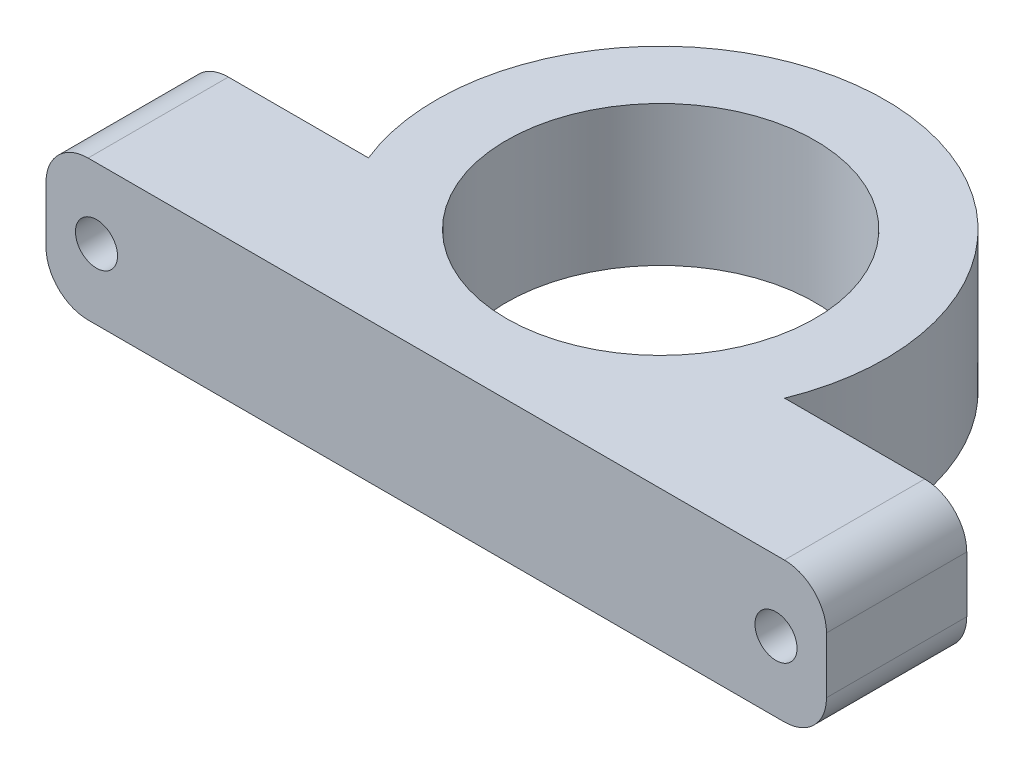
ISO-10303-21;
HEADER;
FILE_DESCRIPTION(('STEP AP214'),'2;1');
FILE_NAME('part.step','',(''),(''),'','','');
FILE_SCHEMA(('AUTOMOTIVE_DESIGN { 1 0 10303 214 1 1 1 1 }'));
ENDSEC;
DATA;
#1=APPLICATION_CONTEXT('core data for automotive mechanical design processes');
#2=APPLICATION_PROTOCOL_DEFINITION('international standard','automotive_design',2000,#1);
#3=PRODUCT_CONTEXT('',#1,'mechanical');
#4=PRODUCT('Part','Part','',(#3));
#5=PRODUCT_RELATED_PRODUCT_CATEGORY('part','',(#4));
#6=PRODUCT_DEFINITION_FORMATION('','',#4);
#7=PRODUCT_DEFINITION_CONTEXT('part definition',#1,'design');
#8=PRODUCT_DEFINITION('design','',#6,#7);
#9=PRODUCT_DEFINITION_SHAPE('','',#8);
#10=(LENGTH_UNIT() NAMED_UNIT(*) SI_UNIT(.MILLI.,.METRE.));
#11=(NAMED_UNIT(*) PLANE_ANGLE_UNIT() SI_UNIT($,.RADIAN.));
#12=(NAMED_UNIT(*) SI_UNIT($,.STERADIAN.) SOLID_ANGLE_UNIT());
#13=UNCERTAINTY_MEASURE_WITH_UNIT(LENGTH_MEASURE(1.E-05),#10,'distance_accuracy_value','');
#14=(GEOMETRIC_REPRESENTATION_CONTEXT(3) GLOBAL_UNCERTAINTY_ASSIGNED_CONTEXT((#13)) GLOBAL_UNIT_ASSIGNED_CONTEXT((#10,
#11,#12)) REPRESENTATION_CONTEXT('',''));
#15=CARTESIAN_POINT('',(0.,0.,0.));
#16=DIRECTION('',(0.,0.,1.));
#17=DIRECTION('',(1.,0.,0.));
#18=AXIS2_PLACEMENT_3D('',#15,#16,#17);
#19=CARTESIAN_POINT('',(0.,10.,0.));
#20=DIRECTION('',(0.,-1.,0.));
#21=DIRECTION('',(0.,0.,-1.));
#22=AXIS2_PLACEMENT_3D('',#19,#20,#21);
#23=CYLINDRICAL_SURFACE('',#22,16.);
#24=CARTESIAN_POINT('',(0.,0.,0.));
#25=DIRECTION('',(0.,1.,0.));
#26=DIRECTION('',(0.,0.,1.));
#27=AXIS2_PLACEMENT_3D('',#24,#25,#26);
#28=CIRCLE('',#27,16.);
#29=CARTESIAN_POINT('',(14.8323969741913,0.,6.));
#30=VERTEX_POINT('',#29);
#31=CARTESIAN_POINT('',(-14.8323969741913,0.,6.));
#32=VERTEX_POINT('',#31);
#33=EDGE_CURVE('E134',#30,#32,#28,.T.);
#34=ORIENTED_EDGE('',*,*,#33,.T.);
#35=DIRECTION('',(0.,-1.,0.));
#36=VECTOR('',#35,1.);
#37=CARTESIAN_POINT('',(-14.8323969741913,10.,6.));
#38=LINE('',#37,#36);
#39=CARTESIAN_POINT('',(-14.8323969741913,10.,6.));
#40=VERTEX_POINT('',#39);
#41=EDGE_CURVE('E116',#40,#32,#38,.T.);
#42=ORIENTED_EDGE('',*,*,#41,.F.);
#43=CARTESIAN_POINT('',(0.,10.,0.));
#44=DIRECTION('',(0.,1.,0.));
#45=DIRECTION('',(0.,0.,1.));
#46=AXIS2_PLACEMENT_3D('',#43,#44,#45);
#47=CIRCLE('',#46,16.);
#48=CARTESIAN_POINT('',(14.8323969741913,10.,6.));
#49=VERTEX_POINT('',#48);
#50=EDGE_CURVE('E120',#49,#40,#47,.T.);
#51=ORIENTED_EDGE('',*,*,#50,.F.);
#52=DIRECTION('',(0.,-1.,0.));
#53=VECTOR('',#52,1.);
#54=CARTESIAN_POINT('',(14.8323969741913,10.,6.));
#55=LINE('',#54,#53);
#56=EDGE_CURVE('E183',#49,#30,#55,.T.);
#57=ORIENTED_EDGE('',*,*,#56,.T.);
#58=EDGE_LOOP('',(#34,#42,#51,#57));
#59=FACE_BOUND('',#58,.T.);
#60=ADVANCED_FACE('F35',(#59),#23,.T.);
#61=CARTESIAN_POINT('',(0.,10.,6.));
#62=DIRECTION('',(0.,0.,-1.));
#63=DIRECTION('',(-1.,0.,0.));
#64=AXIS2_PLACEMENT_3D('',#61,#62,#63);
#65=PLANE('',#64);
#66=CARTESIAN_POINT('',(-24.2185296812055,5.,6.));
#67=DIRECTION('',(0.,0.,-1.));
#68=DIRECTION('',(-1.,0.,0.));
#69=AXIS2_PLACEMENT_3D('',#66,#67,#68);
#70=CIRCLE('',#69,1.5);
#71=CARTESIAN_POINT('',(-25.7185296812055,5.,6.));
#72=VERTEX_POINT('',#71);
#73=EDGE_CURVE('E376',#72,#72,#70,.T.);
#74=ORIENTED_EDGE('',*,*,#73,.F.);
#75=EDGE_LOOP('',(#74));
#76=FACE_BOUND('',#75,.T.);
#77=DIRECTION('',(1.,0.,0.));
#78=VECTOR('',#77,1.);
#79=CARTESIAN_POINT('',(0.,0.,6.));
#80=LINE('',#79,#78);
#81=CARTESIAN_POINT('',(-24.8185296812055,0.,6.));
#82=VERTEX_POINT('',#81);
#83=EDGE_CURVE('E191',#82,#32,#80,.T.);
#84=ORIENTED_EDGE('',*,*,#83,.F.);
#85=CARTESIAN_POINT('',(-24.8185296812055,3.,6.));
#86=DIRECTION('',(0.,0.,-1.));
#87=DIRECTION('',(-1.,0.,0.));
#88=AXIS2_PLACEMENT_3D('',#85,#86,#87);
#89=CIRCLE('',#88,3.);
#90=CARTESIAN_POINT('',(-27.8185296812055,3.,6.));
#91=VERTEX_POINT('',#90);
#92=EDGE_CURVE('E50',#82,#91,#89,.T.);
#93=ORIENTED_EDGE('',*,*,#92,.T.);
#94=DIRECTION('',(0.,-1.,0.));
#95=VECTOR('',#94,1.);
#96=CARTESIAN_POINT('',(-27.8185296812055,10.,6.));
#97=LINE('',#96,#95);
#98=CARTESIAN_POINT('',(-27.8185296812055,7.,6.));
#99=VERTEX_POINT('',#98);
#100=EDGE_CURVE('E136',#99,#91,#97,.T.);
#101=ORIENTED_EDGE('',*,*,#100,.F.);
#102=CARTESIAN_POINT('',(-24.8185296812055,7.,6.));
#103=DIRECTION('',(0.,0.,-1.));
#104=DIRECTION('',(-1.,0.,0.));
#105=AXIS2_PLACEMENT_3D('',#102,#103,#104);
#106=CIRCLE('',#105,3.);
#107=CARTESIAN_POINT('',(-24.8185296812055,10.,6.));
#108=VERTEX_POINT('',#107);
#109=EDGE_CURVE('E58',#99,#108,#106,.T.);
#110=ORIENTED_EDGE('',*,*,#109,.T.);
#111=DIRECTION('',(1.,0.,0.));
#112=VECTOR('',#111,1.);
#113=CARTESIAN_POINT('',(0.,10.,6.));
#114=LINE('',#113,#112);
#115=EDGE_CURVE('E112',#108,#40,#114,.T.);
#116=ORIENTED_EDGE('',*,*,#115,.T.);
#117=ORIENTED_EDGE('',*,*,#41,.T.);
#118=EDGE_LOOP('',(#84,#93,#101,#110,#116,#117));
#119=FACE_BOUND('',#118,.T.);
#120=ADVANCED_FACE('F114',(#76,#119),#65,.T.);
#121=CARTESIAN_POINT('',(-27.8185296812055,10.,0.));
#122=DIRECTION('',(-1.,0.,0.));
#123=DIRECTION('',(0.,0.,1.));
#124=AXIS2_PLACEMENT_3D('',#121,#122,#123);
#125=PLANE('',#124);
#126=ORIENTED_EDGE('',*,*,#100,.T.);
#127=DIRECTION('',(0.,0.,-1.));
#128=VECTOR('',#127,1.);
#129=CARTESIAN_POINT('',(-27.8185296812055,3.,16.));
#130=LINE('',#129,#128);
#131=CARTESIAN_POINT('',(-27.8185296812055,3.,16.));
#132=VERTEX_POINT('',#131);
#133=EDGE_CURVE('E11',#91,#132,#130,.F.);
#134=ORIENTED_EDGE('',*,*,#133,.T.);
#135=DIRECTION('',(0.,-1.,0.));
#136=VECTOR('',#135,1.);
#137=CARTESIAN_POINT('',(-27.8185296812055,10.,16.));
#138=LINE('',#137,#136);
#139=CARTESIAN_POINT('',(-27.8185296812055,7.,16.));
#140=VERTEX_POINT('',#139);
#141=EDGE_CURVE('E140',#140,#132,#138,.T.);
#142=ORIENTED_EDGE('',*,*,#141,.F.);
#143=DIRECTION('',(0.,0.,-1.));
#144=VECTOR('',#143,1.);
#145=CARTESIAN_POINT('',(-27.8185296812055,7.,0.));
#146=LINE('',#145,#144);
#147=EDGE_CURVE('E43',#140,#99,#146,.T.);
#148=ORIENTED_EDGE('',*,*,#147,.T.);
#149=EDGE_LOOP('',(#126,#134,#142,#148));
#150=FACE_BOUND('',#149,.T.);
#151=ADVANCED_FACE('F170',(#150),#125,.T.);
#152=CARTESIAN_POINT('',(0.,10.,16.));
#153=DIRECTION('',(0.,0.,-1.));
#154=DIRECTION('',(-1.,0.,0.));
#155=AXIS2_PLACEMENT_3D('',#152,#153,#154);
#156=PLANE('',#155);
#157=CARTESIAN_POINT('',(-24.2185296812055,5.,16.));
#158=DIRECTION('',(0.,0.,-1.));
#159=DIRECTION('',(-1.,0.,0.));
#160=AXIS2_PLACEMENT_3D('',#157,#158,#159);
#161=CIRCLE('',#160,1.5);
#162=CARTESIAN_POINT('',(-25.7185296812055,5.,16.));
#163=VERTEX_POINT('',#162);
#164=EDGE_CURVE('E368',#163,#163,#161,.T.);
#165=ORIENTED_EDGE('',*,*,#164,.T.);
#166=EDGE_LOOP('',(#165));
#167=FACE_BOUND('',#166,.T.);
#168=CARTESIAN_POINT('',(24.2185296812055,5.,16.));
#169=DIRECTION('',(0.,0.,-1.));
#170=DIRECTION('',(-1.,0.,0.));
#171=AXIS2_PLACEMENT_3D('',#168,#169,#170);
#172=CIRCLE('',#171,1.5);
#173=CARTESIAN_POINT('',(22.7185296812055,5.,16.));
#174=VERTEX_POINT('',#173);
#175=EDGE_CURVE('E189',#174,#174,#172,.T.);
#176=ORIENTED_EDGE('',*,*,#175,.T.);
#177=EDGE_LOOP('',(#176));
#178=FACE_BOUND('',#177,.T.);
#179=DIRECTION('',(1.,0.,0.));
#180=VECTOR('',#179,1.);
#181=CARTESIAN_POINT('',(0.,0.,16.));
#182=LINE('',#181,#180);
#183=CARTESIAN_POINT('',(-24.8185296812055,0.,16.));
#184=VERTEX_POINT('',#183);
#185=CARTESIAN_POINT('',(24.8185296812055,0.,16.));
#186=VERTEX_POINT('',#185);
#187=EDGE_CURVE('E193',#184,#186,#182,.T.);
#188=ORIENTED_EDGE('',*,*,#187,.T.);
#189=CARTESIAN_POINT('',(24.8185296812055,3.,16.));
#190=DIRECTION('',(0.,0.,-1.));
#191=DIRECTION('',(-1.,0.,0.));
#192=AXIS2_PLACEMENT_3D('',#189,#190,#191);
#193=CIRCLE('',#192,3.);
#194=CARTESIAN_POINT('',(27.8185296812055,3.,16.));
#195=VERTEX_POINT('',#194);
#196=EDGE_CURVE('E161',#186,#195,#193,.F.);
#197=ORIENTED_EDGE('',*,*,#196,.T.);
#198=DIRECTION('',(0.,-1.,0.));
#199=VECTOR('',#198,1.);
#200=CARTESIAN_POINT('',(27.8185296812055,10.,16.));
#201=LINE('',#200,#199);
#202=CARTESIAN_POINT('',(27.8185296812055,7.,16.));
#203=VERTEX_POINT('',#202);
#204=EDGE_CURVE('E201',#203,#195,#201,.T.);
#205=ORIENTED_EDGE('',*,*,#204,.F.);
#206=CARTESIAN_POINT('',(24.8185296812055,7.,16.));
#207=DIRECTION('',(0.,0.,-1.));
#208=DIRECTION('',(-1.,0.,0.));
#209=AXIS2_PLACEMENT_3D('',#206,#207,#208);
#210=CIRCLE('',#209,3.);
#211=CARTESIAN_POINT('',(24.8185296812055,10.,16.));
#212=VERTEX_POINT('',#211);
#213=EDGE_CURVE('E159',#203,#212,#210,.F.);
#214=ORIENTED_EDGE('',*,*,#213,.T.);
#215=DIRECTION('',(1.,0.,0.));
#216=VECTOR('',#215,1.);
#217=CARTESIAN_POINT('',(0.,10.,16.));
#218=LINE('',#217,#216);
#219=CARTESIAN_POINT('',(-24.8185296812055,10.,16.));
#220=VERTEX_POINT('',#219);
#221=EDGE_CURVE('E119',#220,#212,#218,.T.);
#222=ORIENTED_EDGE('',*,*,#221,.F.);
#223=CARTESIAN_POINT('',(-24.8185296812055,7.,16.));
#224=DIRECTION('',(0.,0.,-1.));
#225=DIRECTION('',(-1.,0.,0.));
#226=AXIS2_PLACEMENT_3D('',#223,#224,#225);
#227=CIRCLE('',#226,3.);
#228=EDGE_CURVE('E155',#220,#140,#227,.F.);
#229=ORIENTED_EDGE('',*,*,#228,.T.);
#230=ORIENTED_EDGE('',*,*,#141,.T.);
#231=CARTESIAN_POINT('',(-24.8185296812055,3.,16.));
#232=DIRECTION('',(0.,0.,-1.));
#233=DIRECTION('',(-1.,0.,0.));
#234=AXIS2_PLACEMENT_3D('',#231,#232,#233);
#235=CIRCLE('',#234,3.);
#236=EDGE_CURVE('E157',#132,#184,#235,.F.);
#237=ORIENTED_EDGE('',*,*,#236,.T.);
#238=EDGE_LOOP('',(#188,#197,#205,#214,#222,#229,#230,#237));
#239=FACE_BOUND('',#238,.T.);
#240=ADVANCED_FACE('F177',(#167,#178,#239),#156,.F.);
#241=CARTESIAN_POINT('',(27.8185296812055,10.,0.));
#242=DIRECTION('',(-1.,0.,0.));
#243=DIRECTION('',(0.,0.,1.));
#244=AXIS2_PLACEMENT_3D('',#241,#242,#243);
#245=PLANE('',#244);
#246=ORIENTED_EDGE('',*,*,#204,.T.);
#247=DIRECTION('',(0.,0.,-1.));
#248=VECTOR('',#247,1.);
#249=CARTESIAN_POINT('',(27.8185296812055,3.,0.));
#250=LINE('',#249,#248);
#251=CARTESIAN_POINT('',(27.8185296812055,3.,6.));
#252=VERTEX_POINT('',#251);
#253=EDGE_CURVE('E138',#195,#252,#250,.T.);
#254=ORIENTED_EDGE('',*,*,#253,.T.);
#255=DIRECTION('',(0.,-1.,0.));
#256=VECTOR('',#255,1.);
#257=CARTESIAN_POINT('',(27.8185296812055,10.,6.));
#258=LINE('',#257,#256);
#259=CARTESIAN_POINT('',(27.8185296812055,7.,6.));
#260=VERTEX_POINT('',#259);
#261=EDGE_CURVE('E198',#260,#252,#258,.T.);
#262=ORIENTED_EDGE('',*,*,#261,.F.);
#263=DIRECTION('',(0.,0.,-1.));
#264=VECTOR('',#263,1.);
#265=CARTESIAN_POINT('',(27.8185296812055,7.,16.));
#266=LINE('',#265,#264);
#267=EDGE_CURVE('E135',#260,#203,#266,.F.);
#268=ORIENTED_EDGE('',*,*,#267,.T.);
#269=EDGE_LOOP('',(#246,#254,#262,#268));
#270=FACE_BOUND('',#269,.T.);
#271=ADVANCED_FACE('F205',(#270),#245,.F.);
#272=CARTESIAN_POINT('',(0.,10.,0.));
#273=DIRECTION('',(0.,-1.,0.));
#274=DIRECTION('',(0.,0.,-1.));
#275=AXIS2_PLACEMENT_3D('',#272,#273,#274);
#276=CYLINDRICAL_SURFACE('',#275,11.);
#277=CARTESIAN_POINT('',(0.,10.,0.));
#278=DIRECTION('',(0.,1.,0.));
#279=DIRECTION('',(0.,0.,1.));
#280=AXIS2_PLACEMENT_3D('',#277,#278,#279);
#281=CIRCLE('',#280,11.);
#282=CARTESIAN_POINT('',(0.,10.,11.));
#283=VERTEX_POINT('',#282);
#284=EDGE_CURVE('E131',#283,#283,#281,.T.);
#285=ORIENTED_EDGE('',*,*,#284,.T.);
#286=EDGE_LOOP('',(#285));
#287=FACE_BOUND('',#286,.T.);
#288=CARTESIAN_POINT('',(0.,0.,0.));
#289=DIRECTION('',(0.,1.,0.));
#290=DIRECTION('',(0.,0.,1.));
#291=AXIS2_PLACEMENT_3D('',#288,#289,#290);
#292=CIRCLE('',#291,11.);
#293=CARTESIAN_POINT('',(0.,0.,11.));
#294=VERTEX_POINT('',#293);
#295=EDGE_CURVE('E186',#294,#294,#292,.T.);
#296=ORIENTED_EDGE('',*,*,#295,.F.);
#297=EDGE_LOOP('',(#296));
#298=FACE_BOUND('',#297,.T.);
#299=ADVANCED_FACE('F238',(#287,#298),#276,.F.);
#300=CARTESIAN_POINT('',(0.,10.,6.));
#301=DIRECTION('',(0.,0.,1.));
#302=DIRECTION('',(1.,0.,0.));
#303=AXIS2_PLACEMENT_3D('',#300,#301,#302);
#304=PLANE('',#303);
#305=CARTESIAN_POINT('',(24.2185296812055,5.,6.));
#306=DIRECTION('',(0.,0.,-1.));
#307=DIRECTION('',(-1.,0.,0.));
#308=AXIS2_PLACEMENT_3D('',#305,#306,#307);
#309=CIRCLE('',#308,1.5);
#310=CARTESIAN_POINT('',(22.7185296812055,5.,6.));
#311=VERTEX_POINT('',#310);
#312=EDGE_CURVE('E371',#311,#311,#309,.T.);
#313=ORIENTED_EDGE('',*,*,#312,.F.);
#314=EDGE_LOOP('',(#313));
#315=FACE_BOUND('',#314,.T.);
#316=ORIENTED_EDGE('',*,*,#261,.T.);
#317=CARTESIAN_POINT('',(24.8185296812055,3.,6.));
#318=DIRECTION('',(0.,0.,1.));
#319=DIRECTION('',(1.,0.,0.));
#320=AXIS2_PLACEMENT_3D('',#317,#318,#319);
#321=CIRCLE('',#320,3.);
#322=CARTESIAN_POINT('',(24.8185296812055,0.,6.));
#323=VERTEX_POINT('',#322);
#324=EDGE_CURVE('E148',#252,#323,#321,.F.);
#325=ORIENTED_EDGE('',*,*,#324,.T.);
#326=DIRECTION('',(-1.,0.,0.));
#327=VECTOR('',#326,1.);
#328=CARTESIAN_POINT('',(0.,0.,6.));
#329=LINE('',#328,#327);
#330=EDGE_CURVE('E195',#323,#30,#329,.T.);
#331=ORIENTED_EDGE('',*,*,#330,.T.);
#332=ORIENTED_EDGE('',*,*,#56,.F.);
#333=DIRECTION('',(-1.,0.,0.));
#334=VECTOR('',#333,1.);
#335=CARTESIAN_POINT('',(0.,10.,6.));
#336=LINE('',#335,#334);
#337=CARTESIAN_POINT('',(24.8185296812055,10.,6.));
#338=VERTEX_POINT('',#337);
#339=EDGE_CURVE('E127',#338,#49,#336,.T.);
#340=ORIENTED_EDGE('',*,*,#339,.F.);
#341=CARTESIAN_POINT('',(24.8185296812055,7.,6.));
#342=DIRECTION('',(0.,0.,1.));
#343=DIRECTION('',(1.,0.,0.));
#344=AXIS2_PLACEMENT_3D('',#341,#342,#343);
#345=CIRCLE('',#344,3.);
#346=EDGE_CURVE('E146',#338,#260,#345,.F.);
#347=ORIENTED_EDGE('',*,*,#346,.T.);
#348=EDGE_LOOP('',(#316,#325,#331,#332,#340,#347));
#349=FACE_BOUND('',#348,.T.);
#350=ADVANCED_FACE('F214',(#315,#349),#304,.F.);
#351=CARTESIAN_POINT('',(0.,10.,0.));
#352=DIRECTION('',(0.,1.,0.));
#353=DIRECTION('',(0.,0.,1.));
#354=AXIS2_PLACEMENT_3D('',#351,#352,#353);
#355=PLANE('',#354);
#356=ORIENTED_EDGE('',*,*,#284,.F.);
#357=EDGE_LOOP('',(#356));
#358=FACE_BOUND('',#357,.T.);
#359=ORIENTED_EDGE('',*,*,#221,.T.);
#360=DIRECTION('',(0.,0.,-1.));
#361=VECTOR('',#360,1.);
#362=CARTESIAN_POINT('',(24.8185296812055,10.,6.));
#363=LINE('',#362,#361);
#364=EDGE_CURVE('E165',#212,#338,#363,.T.);
#365=ORIENTED_EDGE('',*,*,#364,.T.);
#366=ORIENTED_EDGE('',*,*,#339,.T.);
#367=ORIENTED_EDGE('',*,*,#50,.T.);
#368=ORIENTED_EDGE('',*,*,#115,.F.);
#369=DIRECTION('',(0.,0.,-1.));
#370=VECTOR('',#369,1.);
#371=CARTESIAN_POINT('',(-24.8185296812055,10.,0.));
#372=LINE('',#371,#370);
#373=EDGE_CURVE('E163',#108,#220,#372,.F.);
#374=ORIENTED_EDGE('',*,*,#373,.T.);
#375=EDGE_LOOP('',(#359,#365,#366,#367,#368,#374));
#376=FACE_BOUND('',#375,.T.);
#377=ADVANCED_FACE('F124',(#358,#376),#355,.T.);
#378=CARTESIAN_POINT('',(0.,0.,0.));
#379=DIRECTION('',(0.,1.,0.));
#380=DIRECTION('',(0.,0.,1.));
#381=AXIS2_PLACEMENT_3D('',#378,#379,#380);
#382=PLANE('',#381);
#383=ORIENTED_EDGE('',*,*,#295,.T.);
#384=EDGE_LOOP('',(#383));
#385=FACE_BOUND('',#384,.T.);
#386=ORIENTED_EDGE('',*,*,#330,.F.);
#387=DIRECTION('',(0.,0.,-1.));
#388=VECTOR('',#387,1.);
#389=CARTESIAN_POINT('',(24.8185296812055,0.,0.));
#390=LINE('',#389,#388);
#391=EDGE_CURVE('E153',#323,#186,#390,.F.);
#392=ORIENTED_EDGE('',*,*,#391,.T.);
#393=ORIENTED_EDGE('',*,*,#187,.F.);
#394=DIRECTION('',(0.,0.,-1.));
#395=VECTOR('',#394,1.);
#396=CARTESIAN_POINT('',(-24.8185296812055,0.,6.));
#397=LINE('',#396,#395);
#398=EDGE_CURVE('E150',#184,#82,#397,.T.);
#399=ORIENTED_EDGE('',*,*,#398,.T.);
#400=ORIENTED_EDGE('',*,*,#83,.T.);
#401=ORIENTED_EDGE('',*,*,#33,.F.);
#402=EDGE_LOOP('',(#386,#392,#393,#399,#400,#401));
#403=FACE_BOUND('',#402,.T.);
#404=ADVANCED_FACE('F216',(#385,#403),#382,.F.);
#405=CARTESIAN_POINT('',(24.2185296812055,5.,16.));
#406=DIRECTION('',(0.,0.,-1.));
#407=DIRECTION('',(-1.,0.,0.));
#408=AXIS2_PLACEMENT_3D('',#405,#406,#407);
#409=CYLINDRICAL_SURFACE('',#408,1.5);
#410=ORIENTED_EDGE('',*,*,#175,.F.);
#411=EDGE_LOOP('',(#410));
#412=FACE_BOUND('',#411,.T.);
#413=ORIENTED_EDGE('',*,*,#312,.T.);
#414=EDGE_LOOP('',(#413));
#415=FACE_BOUND('',#414,.T.);
#416=ADVANCED_FACE('F247',(#412,#415),#409,.F.);
#417=CARTESIAN_POINT('',(-24.2185296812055,5.,16.));
#418=DIRECTION('',(0.,0.,-1.));
#419=DIRECTION('',(-1.,0.,0.));
#420=AXIS2_PLACEMENT_3D('',#417,#418,#419);
#421=CYLINDRICAL_SURFACE('',#420,1.5);
#422=ORIENTED_EDGE('',*,*,#164,.F.);
#423=EDGE_LOOP('',(#422));
#424=FACE_BOUND('',#423,.T.);
#425=ORIENTED_EDGE('',*,*,#73,.T.);
#426=EDGE_LOOP('',(#425));
#427=FACE_BOUND('',#426,.T.);
#428=ADVANCED_FACE('F243',(#424,#427),#421,.F.);
#429=CARTESIAN_POINT('',(24.8185296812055,3.,0.));
#430=DIRECTION('',(0.,0.,-1.));
#431=DIRECTION('',(-1.,0.,0.));
#432=AXIS2_PLACEMENT_3D('',#429,#430,#431);
#433=CYLINDRICAL_SURFACE('',#432,3.);
#434=ORIENTED_EDGE('',*,*,#196,.F.);
#435=ORIENTED_EDGE('',*,*,#391,.F.);
#436=ORIENTED_EDGE('',*,*,#324,.F.);
#437=ORIENTED_EDGE('',*,*,#253,.F.);
#438=EDGE_LOOP('',(#434,#435,#436,#437));
#439=FACE_BOUND('',#438,.T.);
#440=ADVANCED_FACE('F210',(#439),#433,.T.);
#441=CARTESIAN_POINT('',(24.8185296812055,7.,0.));
#442=DIRECTION('',(0.,0.,1.));
#443=DIRECTION('',(1.,0.,0.));
#444=AXIS2_PLACEMENT_3D('',#441,#442,#443);
#445=CYLINDRICAL_SURFACE('',#444,3.);
#446=ORIENTED_EDGE('',*,*,#213,.F.);
#447=ORIENTED_EDGE('',*,*,#267,.F.);
#448=ORIENTED_EDGE('',*,*,#346,.F.);
#449=ORIENTED_EDGE('',*,*,#364,.F.);
#450=EDGE_LOOP('',(#446,#447,#448,#449));
#451=FACE_BOUND('',#450,.T.);
#452=ADVANCED_FACE('F222',(#451),#445,.T.);
#453=CARTESIAN_POINT('',(-24.8185296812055,3.,0.));
#454=DIRECTION('',(0.,0.,1.));
#455=DIRECTION('',(1.,0.,0.));
#456=AXIS2_PLACEMENT_3D('',#453,#454,#455);
#457=CYLINDRICAL_SURFACE('',#456,3.);
#458=ORIENTED_EDGE('',*,*,#236,.F.);
#459=ORIENTED_EDGE('',*,*,#133,.F.);
#460=ORIENTED_EDGE('',*,*,#92,.F.);
#461=ORIENTED_EDGE('',*,*,#398,.F.);
#462=EDGE_LOOP('',(#458,#459,#460,#461));
#463=FACE_BOUND('',#462,.T.);
#464=ADVANCED_FACE('F220',(#463),#457,.T.);
#465=CARTESIAN_POINT('',(-24.8185296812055,7.,0.));
#466=DIRECTION('',(0.,0.,-1.));
#467=DIRECTION('',(-1.,0.,0.));
#468=AXIS2_PLACEMENT_3D('',#465,#466,#467);
#469=CYLINDRICAL_SURFACE('',#468,3.);
#470=ORIENTED_EDGE('',*,*,#228,.F.);
#471=ORIENTED_EDGE('',*,*,#373,.F.);
#472=ORIENTED_EDGE('',*,*,#109,.F.);
#473=ORIENTED_EDGE('',*,*,#147,.F.);
#474=EDGE_LOOP('',(#470,#471,#472,#473));
#475=FACE_BOUND('',#474,.T.);
#476=ADVANCED_FACE('F37',(#475),#469,.T.);
#477=CLOSED_SHELL('',(#60,#120,#151,#240,#271,#299,#350,#377,#404,#416,#428,#440,#452,#464,#476));
#478=MANIFOLD_SOLID_BREP('B2',#477);
#479=ADVANCED_BREP_SHAPE_REPRESENTATION('',(#18,#478),#14);
#480=SHAPE_DEFINITION_REPRESENTATION(#9,#479);
ENDSEC;
END-ISO-10303-21;
